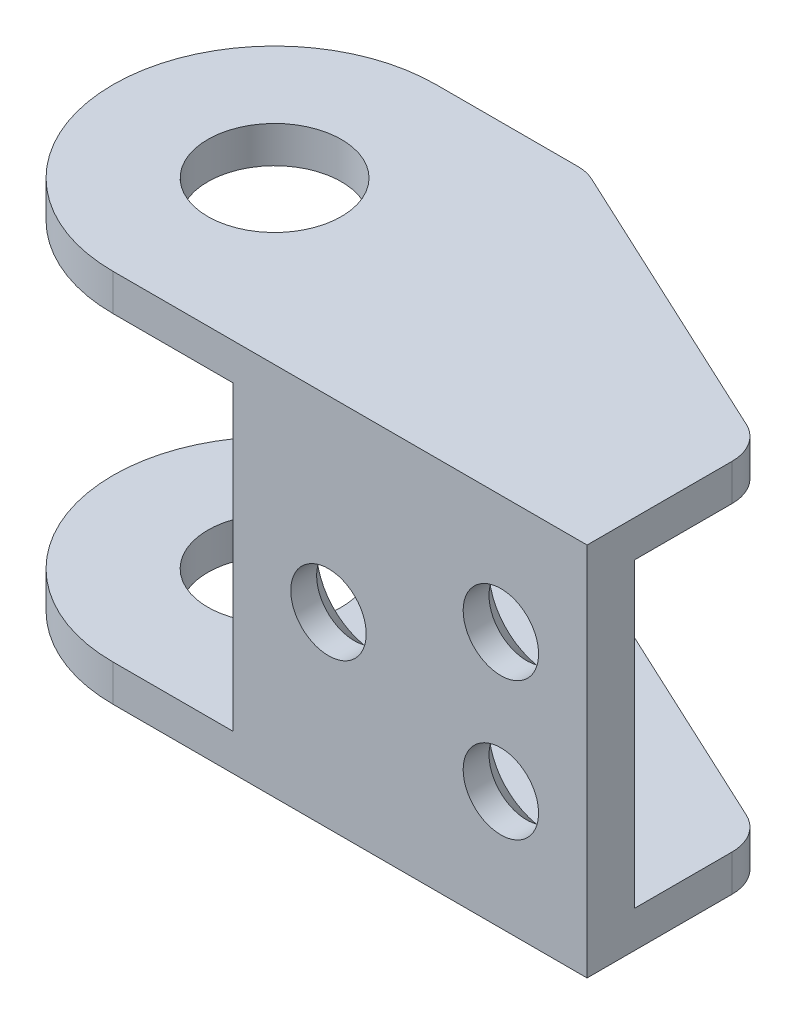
ISO-10303-21;
HEADER;
FILE_DESCRIPTION(('STEP AP214'),'2;1');
FILE_NAME('part.step','',(''),(''),'','','');
FILE_SCHEMA(('AUTOMOTIVE_DESIGN { 1 0 10303 214 1 1 1 1 }'));
ENDSEC;
DATA;
#1=APPLICATION_CONTEXT('core data for automotive mechanical design processes');
#2=APPLICATION_PROTOCOL_DEFINITION('international standard','automotive_design',2000,#1);
#3=PRODUCT_CONTEXT('',#1,'mechanical');
#4=PRODUCT('Part','Part','',(#3));
#5=PRODUCT_RELATED_PRODUCT_CATEGORY('part','',(#4));
#6=PRODUCT_DEFINITION_FORMATION('','',#4);
#7=PRODUCT_DEFINITION_CONTEXT('part definition',#1,'design');
#8=PRODUCT_DEFINITION('design','',#6,#7);
#9=PRODUCT_DEFINITION_SHAPE('','',#8);
#10=(LENGTH_UNIT() NAMED_UNIT(*) SI_UNIT(.MILLI.,.METRE.));
#11=(NAMED_UNIT(*) PLANE_ANGLE_UNIT() SI_UNIT($,.RADIAN.));
#12=(NAMED_UNIT(*) SI_UNIT($,.STERADIAN.) SOLID_ANGLE_UNIT());
#13=UNCERTAINTY_MEASURE_WITH_UNIT(LENGTH_MEASURE(1.E-05),#10,'distance_accuracy_value','');
#14=(GEOMETRIC_REPRESENTATION_CONTEXT(3) GLOBAL_UNCERTAINTY_ASSIGNED_CONTEXT((#13)) GLOBAL_UNIT_ASSIGNED_CONTEXT((#10,
#11,#12)) REPRESENTATION_CONTEXT('',''));
#15=CARTESIAN_POINT('',(0.,0.,0.));
#16=DIRECTION('',(0.,0.,1.));
#17=DIRECTION('',(1.,0.,0.));
#18=AXIS2_PLACEMENT_3D('',#15,#16,#17);
#19=CARTESIAN_POINT('',(-511.,5.,61.3));
#20=DIRECTION('',(0.,0.,1.));
#21=DIRECTION('',(1.,0.,0.));
#22=AXIS2_PLACEMENT_3D('',#19,#20,#21);
#23=PLANE('',#22);
#24=CARTESIAN_POINT('',(-507.,8.2,61.3));
#25=DIRECTION('',(0.,0.,-1.));
#26=DIRECTION('',(-1.,0.,0.));
#27=AXIS2_PLACEMENT_3D('',#24,#25,#26);
#28=CIRCLE('',#27,2.75000000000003);
#29=CARTESIAN_POINT('',(-509.75,8.2,61.3));
#30=VERTEX_POINT('',#29);
#31=EDGE_CURVE('E657',#30,#30,#28,.T.);
#32=ORIENTED_EDGE('',*,*,#31,.F.);
#33=EDGE_LOOP('',(#32));
#34=FACE_BOUND('',#33,.T.);
#35=CARTESIAN_POINT('',(-507.,1.8,61.3));
#36=DIRECTION('',(0.,0.,-1.));
#37=DIRECTION('',(-1.,0.,0.));
#38=AXIS2_PLACEMENT_3D('',#35,#36,#37);
#39=CIRCLE('',#38,2.75000000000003);
#40=CARTESIAN_POINT('',(-509.75,1.8,61.3));
#41=VERTEX_POINT('',#40);
#42=EDGE_CURVE('E648',#41,#41,#39,.T.);
#43=ORIENTED_EDGE('',*,*,#42,.F.);
#44=EDGE_LOOP('',(#43));
#45=FACE_BOUND('',#44,.T.);
#46=CARTESIAN_POINT('',(-515.,5.,61.3));
#47=DIRECTION('',(0.,0.,-1.));
#48=DIRECTION('',(-1.,0.,0.));
#49=AXIS2_PLACEMENT_3D('',#46,#47,#48);
#50=CIRCLE('',#49,2.75000000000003);
#51=CARTESIAN_POINT('',(-517.75,5.,61.3));
#52=VERTEX_POINT('',#51);
#53=EDGE_CURVE('E630',#52,#52,#50,.T.);
#54=ORIENTED_EDGE('',*,*,#53,.F.);
#55=EDGE_LOOP('',(#54));
#56=FACE_BOUND('',#55,.T.);
#57=DIRECTION('',(-1.,0.,0.));
#58=VECTOR('',#57,1.);
#59=CARTESIAN_POINT('',(-490.08760285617,12.,61.3));
#60=LINE('',#59,#58);
#61=CARTESIAN_POINT('',(-503.,12.,61.3));
#62=VERTEX_POINT('',#61);
#63=CARTESIAN_POINT('',(-519.44,12.,61.3));
#64=VERTEX_POINT('',#63);
#65=EDGE_CURVE('E235',#62,#64,#60,.T.);
#66=ORIENTED_EDGE('',*,*,#65,.F.);
#67=DIRECTION('',(0.,1.,0.));
#68=VECTOR('',#67,1.);
#69=CARTESIAN_POINT('',(-503.,5.,61.3));
#70=LINE('',#69,#68);
#71=CARTESIAN_POINT('',(-503.,-2.,61.3));
#72=VERTEX_POINT('',#71);
#73=EDGE_CURVE('E225',#72,#62,#70,.T.);
#74=ORIENTED_EDGE('',*,*,#73,.F.);
#75=DIRECTION('',(-1.,0.,0.));
#76=VECTOR('',#75,1.);
#77=CARTESIAN_POINT('',(-490.08760285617,-2.,61.3));
#78=LINE('',#77,#76);
#79=CARTESIAN_POINT('',(-519.44,-2.,61.3));
#80=VERTEX_POINT('',#79);
#81=EDGE_CURVE('E202',#72,#80,#78,.T.);
#82=ORIENTED_EDGE('',*,*,#81,.T.);
#83=DIRECTION('',(0.,1.,0.));
#84=VECTOR('',#83,1.);
#85=CARTESIAN_POINT('',(-519.44,10.,61.3));
#86=LINE('',#85,#84);
#87=EDGE_CURVE('E214',#80,#64,#86,.T.);
#88=ORIENTED_EDGE('',*,*,#87,.T.);
#89=EDGE_LOOP('',(#66,#74,#82,#88));
#90=FACE_BOUND('',#89,.T.);
#91=ADVANCED_FACE('F49',(#34,#45,#56,#90),#23,.F.);
#92=CARTESIAN_POINT('',(-525.,11.85,56.));
#93=DIRECTION('',(0.,1.,0.));
#94=DIRECTION('',(0.,0.,1.));
#95=AXIS2_PLACEMENT_3D('',#92,#93,#94);
#96=CYLINDRICAL_SURFACE('',#95,7.5);
#97=DIRECTION('',(0.,1.,0.));
#98=VECTOR('',#97,1.);
#99=CARTESIAN_POINT('',(-525.,11.85,63.5));
#100=LINE('',#99,#98);
#101=CARTESIAN_POINT('',(-525.,12.,63.5));
#102=VERTEX_POINT('',#101);
#103=CARTESIAN_POINT('',(-525.,13.7,63.5));
#104=VERTEX_POINT('',#103);
#105=EDGE_CURVE('E221',#102,#104,#100,.T.);
#106=ORIENTED_EDGE('',*,*,#105,.T.);
#107=CARTESIAN_POINT('',(-525.,13.7,56.));
#108=DIRECTION('',(0.,1.,0.));
#109=DIRECTION('',(0.,0.,1.));
#110=AXIS2_PLACEMENT_3D('',#107,#108,#109);
#111=CIRCLE('',#110,7.5);
#112=CARTESIAN_POINT('',(-525.,13.7,48.5));
#113=VERTEX_POINT('',#112);
#114=EDGE_CURVE('E288',#113,#104,#111,.T.);
#115=ORIENTED_EDGE('',*,*,#114,.F.);
#116=DIRECTION('',(0.,1.,0.));
#117=VECTOR('',#116,1.);
#118=CARTESIAN_POINT('',(-525.,11.85,48.5));
#119=LINE('',#118,#117);
#120=CARTESIAN_POINT('',(-525.,12.,48.5));
#121=VERTEX_POINT('',#120);
#122=EDGE_CURVE('E268',#113,#121,#119,.F.);
#123=ORIENTED_EDGE('',*,*,#122,.T.);
#124=CARTESIAN_POINT('',(-525.,12.,56.));
#125=DIRECTION('',(0.,1.,0.));
#126=DIRECTION('',(0.,0.,1.));
#127=AXIS2_PLACEMENT_3D('',#124,#125,#126);
#128=CIRCLE('',#127,7.5);
#129=EDGE_CURVE('E292',#121,#102,#128,.T.);
#130=ORIENTED_EDGE('',*,*,#129,.T.);
#131=EDGE_LOOP('',(#106,#115,#123,#130));
#132=FACE_BOUND('',#131,.T.);
#133=ADVANCED_FACE('F348',(#132),#96,.T.);
#134=CARTESIAN_POINT('',(-525.,11.85,56.));
#135=DIRECTION('',(0.,1.,0.));
#136=DIRECTION('',(0.,0.,1.));
#137=AXIS2_PLACEMENT_3D('',#134,#135,#136);
#138=CYLINDRICAL_SURFACE('',#137,3.1);
#139=CARTESIAN_POINT('',(-525.,13.7,56.));
#140=DIRECTION('',(0.,1.,0.));
#141=DIRECTION('',(0.,0.,1.));
#142=AXIS2_PLACEMENT_3D('',#139,#140,#141);
#143=CIRCLE('',#142,3.1);
#144=CARTESIAN_POINT('',(-525.,13.7,59.1));
#145=VERTEX_POINT('',#144);
#146=EDGE_CURVE('E283',#145,#145,#143,.F.);
#147=ORIENTED_EDGE('',*,*,#146,.F.);
#148=EDGE_LOOP('',(#147));
#149=FACE_BOUND('',#148,.T.);
#150=CARTESIAN_POINT('',(-525.,12.,56.));
#151=DIRECTION('',(0.,1.,0.));
#152=DIRECTION('',(0.,0.,1.));
#153=AXIS2_PLACEMENT_3D('',#150,#151,#152);
#154=CIRCLE('',#153,3.1);
#155=CARTESIAN_POINT('',(-525.,12.,59.1));
#156=VERTEX_POINT('',#155);
#157=EDGE_CURVE('E258',#156,#156,#154,.F.);
#158=ORIENTED_EDGE('',*,*,#157,.T.);
#159=EDGE_LOOP('',(#158));
#160=FACE_BOUND('',#159,.T.);
#161=ADVANCED_FACE('F485',(#149,#160),#138,.F.);
#162=CARTESIAN_POINT('',(-514.,11.85,48.5));
#163=DIRECTION('',(0.,0.,1.));
#164=DIRECTION('',(1.,0.,0.));
#165=AXIS2_PLACEMENT_3D('',#162,#163,#164);
#166=PLANE('',#165);
#167=DIRECTION('',(1.,0.,0.));
#168=VECTOR('',#167,1.);
#169=CARTESIAN_POINT('',(-525.,13.7,48.5));
#170=LINE('',#169,#168);
#171=CARTESIAN_POINT('',(-518.443389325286,13.7,48.5));
#172=VERTEX_POINT('',#171);
#173=EDGE_CURVE('E291',#172,#113,#170,.F.);
#174=ORIENTED_EDGE('',*,*,#173,.F.);
#175=DIRECTION('',(0.,-1.,0.));
#176=VECTOR('',#175,1.);
#177=CARTESIAN_POINT('',(-518.443389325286,11.85,48.5));
#178=LINE('',#177,#176);
#179=CARTESIAN_POINT('',(-518.443389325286,12.,48.5));
#180=VERTEX_POINT('',#179);
#181=EDGE_CURVE('E317',#172,#180,#178,.T.);
#182=ORIENTED_EDGE('',*,*,#181,.T.);
#183=DIRECTION('',(1.,0.,0.));
#184=VECTOR('',#183,1.);
#185=CARTESIAN_POINT('',(-525.,12.,48.5));
#186=LINE('',#185,#184);
#187=EDGE_CURVE('E294',#180,#121,#186,.F.);
#188=ORIENTED_EDGE('',*,*,#187,.T.);
#189=ORIENTED_EDGE('',*,*,#122,.F.);
#190=EDGE_LOOP('',(#174,#182,#188,#189));
#191=FACE_BOUND('',#190,.T.);
#192=ADVANCED_FACE('F482',(#191),#166,.F.);
#193=CARTESIAN_POINT('',(-525.,-1.85,56.));
#194=DIRECTION('',(0.,-1.,0.));
#195=DIRECTION('',(0.,0.,-1.));
#196=AXIS2_PLACEMENT_3D('',#193,#194,#195);
#197=CYLINDRICAL_SURFACE('',#196,3.1);
#198=CARTESIAN_POINT('',(-525.,-2.,56.));
#199=DIRECTION('',(0.,-1.,0.));
#200=DIRECTION('',(0.,0.,-1.));
#201=AXIS2_PLACEMENT_3D('',#198,#199,#200);
#202=CIRCLE('',#201,3.1);
#203=CARTESIAN_POINT('',(-525.,-2.,52.9));
#204=VERTEX_POINT('',#203);
#205=EDGE_CURVE('E243',#204,#204,#202,.F.);
#206=ORIENTED_EDGE('',*,*,#205,.T.);
#207=EDGE_LOOP('',(#206));
#208=FACE_BOUND('',#207,.T.);
#209=CARTESIAN_POINT('',(-525.,-3.7,56.));
#210=DIRECTION('',(0.,-1.,0.));
#211=DIRECTION('',(0.,0.,-1.));
#212=AXIS2_PLACEMENT_3D('',#209,#210,#211);
#213=CIRCLE('',#212,3.1);
#214=CARTESIAN_POINT('',(-525.,-3.7,52.9));
#215=VERTEX_POINT('',#214);
#216=EDGE_CURVE('E275',#215,#215,#213,.F.);
#217=ORIENTED_EDGE('',*,*,#216,.F.);
#218=EDGE_LOOP('',(#217));
#219=FACE_BOUND('',#218,.T.);
#220=ADVANCED_FACE('F484',(#208,#219),#197,.F.);
#221=CARTESIAN_POINT('',(-514.,-1.85,48.5));
#222=DIRECTION('',(0.,0.,1.));
#223=DIRECTION('',(1.,0.,0.));
#224=AXIS2_PLACEMENT_3D('',#221,#222,#223);
#225=PLANE('',#224);
#226=DIRECTION('',(1.,0.,0.));
#227=VECTOR('',#226,1.);
#228=CARTESIAN_POINT('',(-525.,-2.,48.5));
#229=LINE('',#228,#227);
#230=CARTESIAN_POINT('',(-525.,-2.,48.5));
#231=VERTEX_POINT('',#230);
#232=CARTESIAN_POINT('',(-518.443389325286,-2.,48.5));
#233=VERTEX_POINT('',#232);
#234=EDGE_CURVE('E239',#231,#233,#229,.T.);
#235=ORIENTED_EDGE('',*,*,#234,.T.);
#236=DIRECTION('',(0.,-1.,0.));
#237=VECTOR('',#236,1.);
#238=CARTESIAN_POINT('',(-518.443389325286,-1.85,48.5));
#239=LINE('',#238,#237);
#240=CARTESIAN_POINT('',(-518.443389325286,-3.7,48.5));
#241=VERTEX_POINT('',#240);
#242=EDGE_CURVE('E384',#233,#241,#239,.T.);
#243=ORIENTED_EDGE('',*,*,#242,.T.);
#244=DIRECTION('',(1.,0.,0.));
#245=VECTOR('',#244,1.);
#246=CARTESIAN_POINT('',(-525.,-3.7,48.5));
#247=LINE('',#246,#245);
#248=CARTESIAN_POINT('',(-525.,-3.7,48.5));
#249=VERTEX_POINT('',#248);
#250=EDGE_CURVE('E254',#249,#241,#247,.T.);
#251=ORIENTED_EDGE('',*,*,#250,.F.);
#252=DIRECTION('',(0.,1.,0.));
#253=VECTOR('',#252,1.);
#254=CARTESIAN_POINT('',(-525.,-1.85,48.5));
#255=LINE('',#254,#253);
#256=EDGE_CURVE('E338',#231,#249,#255,.F.);
#257=ORIENTED_EDGE('',*,*,#256,.F.);
#258=EDGE_LOOP('',(#235,#243,#251,#257));
#259=FACE_BOUND('',#258,.T.);
#260=ADVANCED_FACE('F491',(#259),#225,.F.);
#261=CARTESIAN_POINT('',(-525.,-1.85,56.));
#262=DIRECTION('',(0.,-1.,0.));
#263=DIRECTION('',(0.,0.,-1.));
#264=AXIS2_PLACEMENT_3D('',#261,#262,#263);
#265=CYLINDRICAL_SURFACE('',#264,7.5);
#266=DIRECTION('',(0.,-1.,0.));
#267=VECTOR('',#266,1.);
#268=CARTESIAN_POINT('',(-525.,-1.85,63.5));
#269=LINE('',#268,#267);
#270=CARTESIAN_POINT('',(-525.,-3.7,63.5));
#271=VERTEX_POINT('',#270);
#272=CARTESIAN_POINT('',(-525.,-2.,63.5));
#273=VERTEX_POINT('',#272);
#274=EDGE_CURVE('E263',#271,#273,#269,.F.);
#275=ORIENTED_EDGE('',*,*,#274,.T.);
#276=CARTESIAN_POINT('',(-525.,-2.,56.));
#277=DIRECTION('',(0.,-1.,0.));
#278=DIRECTION('',(0.,0.,-1.));
#279=AXIS2_PLACEMENT_3D('',#276,#277,#278);
#280=CIRCLE('',#279,7.5);
#281=EDGE_CURVE('E211',#273,#231,#280,.T.);
#282=ORIENTED_EDGE('',*,*,#281,.T.);
#283=ORIENTED_EDGE('',*,*,#256,.T.);
#284=CARTESIAN_POINT('',(-525.,-3.7,56.));
#285=DIRECTION('',(0.,-1.,0.));
#286=DIRECTION('',(0.,0.,-1.));
#287=AXIS2_PLACEMENT_3D('',#284,#285,#286);
#288=CIRCLE('',#287,7.5);
#289=EDGE_CURVE('E279',#271,#249,#288,.T.);
#290=ORIENTED_EDGE('',*,*,#289,.F.);
#291=EDGE_LOOP('',(#275,#282,#283,#290));
#292=FACE_BOUND('',#291,.T.);
#293=ADVANCED_FACE('F528',(#292),#265,.T.);
#294=CARTESIAN_POINT('',(-525.,12.,56.));
#295=DIRECTION('',(0.,1.,0.));
#296=DIRECTION('',(0.,0.,1.));
#297=AXIS2_PLACEMENT_3D('',#294,#295,#296);
#298=PLANE('',#297);
#299=ORIENTED_EDGE('',*,*,#187,.F.);
#300=CARTESIAN_POINT('',(-518.443389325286,12.,50.5));
#301=DIRECTION('',(0.,1.,0.));
#302=DIRECTION('',(0.,0.,1.));
#303=AXIS2_PLACEMENT_3D('',#300,#301,#302);
#304=CIRCLE('',#303,2.);
#305=CARTESIAN_POINT('',(-517.598152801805,12.,48.6873844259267));
#306=VERTEX_POINT('',#305);
#307=EDGE_CURVE('E413',#180,#306,#304,.F.);
#308=ORIENTED_EDGE('',*,*,#307,.T.);
#309=DIRECTION('',(0.906307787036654,0.,0.422618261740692));
#310=VECTOR('',#309,1.);
#311=CARTESIAN_POINT('',(-520.877089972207,12.,47.158390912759));
#312=LINE('',#311,#310);
#313=CARTESIAN_POINT('',(-504.154763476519,12.,54.9561398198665));
#314=VERTEX_POINT('',#313);
#315=EDGE_CURVE('E459',#306,#314,#312,.T.);
#316=ORIENTED_EDGE('',*,*,#315,.T.);
#317=CARTESIAN_POINT('',(-505.,12.,56.7687553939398));
#318=DIRECTION('',(0.,1.,0.));
#319=DIRECTION('',(0.,0.,1.));
#320=AXIS2_PLACEMENT_3D('',#317,#318,#319);
#321=CIRCLE('',#320,2.);
#322=CARTESIAN_POINT('',(-503.,12.,56.7687553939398));
#323=VERTEX_POINT('',#322);
#324=EDGE_CURVE('E408',#314,#323,#321,.F.);
#325=ORIENTED_EDGE('',*,*,#324,.T.);
#326=DIRECTION('',(0.,0.,1.));
#327=VECTOR('',#326,1.);
#328=CARTESIAN_POINT('',(-503.,12.,61.3));
#329=LINE('',#328,#327);
#330=EDGE_CURVE('E228',#323,#62,#329,.T.);
#331=ORIENTED_EDGE('',*,*,#330,.T.);
#332=ORIENTED_EDGE('',*,*,#65,.T.);
#333=DIRECTION('',(0.,0.,1.));
#334=VECTOR('',#333,1.);
#335=CARTESIAN_POINT('',(-519.44,12.,56.));
#336=LINE('',#335,#334);
#337=CARTESIAN_POINT('',(-519.44,12.,63.5));
#338=VERTEX_POINT('',#337);
#339=EDGE_CURVE('E216',#338,#64,#336,.F.);
#340=ORIENTED_EDGE('',*,*,#339,.F.);
#341=DIRECTION('',(-1.,0.,0.));
#342=VECTOR('',#341,1.);
#343=CARTESIAN_POINT('',(-511.,12.,63.5));
#344=LINE('',#343,#342);
#345=EDGE_CURVE('E325',#338,#102,#344,.T.);
#346=ORIENTED_EDGE('',*,*,#345,.T.);
#347=ORIENTED_EDGE('',*,*,#129,.F.);
#348=EDGE_LOOP('',(#299,#308,#316,#325,#331,#332,#340,#346,#347));
#349=FACE_BOUND('',#348,.T.);
#350=ORIENTED_EDGE('',*,*,#157,.F.);
#351=EDGE_LOOP('',(#350));
#352=FACE_BOUND('',#351,.T.);
#353=ADVANCED_FACE('F351',(#349,#352),#298,.F.);
#354=CARTESIAN_POINT('',(-525.,13.7,56.));
#355=DIRECTION('',(0.,1.,0.));
#356=DIRECTION('',(0.,0.,1.));
#357=AXIS2_PLACEMENT_3D('',#354,#355,#356);
#358=PLANE('',#357);
#359=DIRECTION('',(0.906307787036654,0.,0.422618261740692));
#360=VECTOR('',#359,1.);
#361=CARTESIAN_POINT('',(-520.877089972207,13.7,47.158390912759));
#362=LINE('',#361,#360);
#363=CARTESIAN_POINT('',(-517.598152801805,13.7,48.6873844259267));
#364=VERTEX_POINT('',#363);
#365=CARTESIAN_POINT('',(-504.154763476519,13.7,54.9561398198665));
#366=VERTEX_POINT('',#365);
#367=EDGE_CURVE('E452',#364,#366,#362,.T.);
#368=ORIENTED_EDGE('',*,*,#367,.F.);
#369=CARTESIAN_POINT('',(-518.443389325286,13.7,50.5));
#370=DIRECTION('',(0.,1.,0.));
#371=DIRECTION('',(0.,0.,1.));
#372=AXIS2_PLACEMENT_3D('',#369,#370,#371);
#373=CIRCLE('',#372,2.);
#374=EDGE_CURVE('E429',#364,#172,#373,.T.);
#375=ORIENTED_EDGE('',*,*,#374,.T.);
#376=ORIENTED_EDGE('',*,*,#173,.T.);
#377=ORIENTED_EDGE('',*,*,#114,.T.);
#378=DIRECTION('',(-1.,0.,0.));
#379=VECTOR('',#378,1.);
#380=CARTESIAN_POINT('',(-511.,13.7,63.5));
#381=LINE('',#380,#379);
#382=CARTESIAN_POINT('',(-503.,13.7,63.5));
#383=VERTEX_POINT('',#382);
#384=EDGE_CURVE('E329',#104,#383,#381,.F.);
#385=ORIENTED_EDGE('',*,*,#384,.T.);
#386=DIRECTION('',(0.,0.,1.));
#387=VECTOR('',#386,1.);
#388=CARTESIAN_POINT('',(-503.,13.7,62.4));
#389=LINE('',#388,#387);
#390=CARTESIAN_POINT('',(-503.,13.7,56.7687553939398));
#391=VERTEX_POINT('',#390);
#392=EDGE_CURVE('E287',#383,#391,#389,.F.);
#393=ORIENTED_EDGE('',*,*,#392,.T.);
#394=CARTESIAN_POINT('',(-505.,13.7,56.7687553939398));
#395=DIRECTION('',(0.,1.,0.));
#396=DIRECTION('',(0.,0.,1.));
#397=AXIS2_PLACEMENT_3D('',#394,#395,#396);
#398=CIRCLE('',#397,2.);
#399=EDGE_CURVE('E75',#391,#366,#398,.T.);
#400=ORIENTED_EDGE('',*,*,#399,.T.);
#401=EDGE_LOOP('',(#368,#375,#376,#377,#385,#393,#400));
#402=FACE_BOUND('',#401,.T.);
#403=ORIENTED_EDGE('',*,*,#146,.T.);
#404=EDGE_LOOP('',(#403));
#405=FACE_BOUND('',#404,.T.);
#406=ADVANCED_FACE('F480',(#402,#405),#358,.T.);
#407=CARTESIAN_POINT('',(-503.,5.,62.4));
#408=DIRECTION('',(-1.,0.,0.));
#409=DIRECTION('',(0.,0.,1.));
#410=AXIS2_PLACEMENT_3D('',#407,#408,#409);
#411=PLANE('',#410);
#412=ORIENTED_EDGE('',*,*,#330,.F.);
#413=DIRECTION('',(0.,-1.,0.));
#414=VECTOR('',#413,1.);
#415=CARTESIAN_POINT('',(-503.,5.,56.7687553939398));
#416=LINE('',#415,#414);
#417=EDGE_CURVE('E11',#323,#391,#416,.F.);
#418=ORIENTED_EDGE('',*,*,#417,.T.);
#419=ORIENTED_EDGE('',*,*,#392,.F.);
#420=DIRECTION('',(0.,1.,0.));
#421=VECTOR('',#420,1.);
#422=CARTESIAN_POINT('',(-503.,5.,63.5));
#423=LINE('',#422,#421);
#424=CARTESIAN_POINT('',(-503.,-3.7,63.5));
#425=VERTEX_POINT('',#424);
#426=EDGE_CURVE('E361',#383,#425,#423,.F.);
#427=ORIENTED_EDGE('',*,*,#426,.T.);
#428=DIRECTION('',(0.,0.,-1.));
#429=VECTOR('',#428,1.);
#430=CARTESIAN_POINT('',(-503.,-3.7,56.));
#431=LINE('',#430,#429);
#432=CARTESIAN_POINT('',(-503.,-3.7,56.7687553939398));
#433=VERTEX_POINT('',#432);
#434=EDGE_CURVE('E282',#433,#425,#431,.F.);
#435=ORIENTED_EDGE('',*,*,#434,.F.);
#436=DIRECTION('',(0.,-1.,0.));
#437=VECTOR('',#436,1.);
#438=CARTESIAN_POINT('',(-503.,5.,56.7687553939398));
#439=LINE('',#438,#437);
#440=CARTESIAN_POINT('',(-503.,-2.,56.7687553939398));
#441=VERTEX_POINT('',#440);
#442=EDGE_CURVE('E58',#433,#441,#439,.F.);
#443=ORIENTED_EDGE('',*,*,#442,.T.);
#444=DIRECTION('',(0.,0.,-1.));
#445=VECTOR('',#444,1.);
#446=CARTESIAN_POINT('',(-503.,-2.,48.5));
#447=LINE('',#446,#445);
#448=EDGE_CURVE('E222',#72,#441,#447,.T.);
#449=ORIENTED_EDGE('',*,*,#448,.F.);
#450=ORIENTED_EDGE('',*,*,#73,.T.);
#451=EDGE_LOOP('',(#412,#418,#419,#427,#435,#443,#449,#450));
#452=FACE_BOUND('',#451,.T.);
#453=ADVANCED_FACE('F436',(#452),#411,.F.);
#454=CARTESIAN_POINT('',(-525.,-3.7,56.));
#455=DIRECTION('',(0.,-1.,0.));
#456=DIRECTION('',(0.,0.,-1.));
#457=AXIS2_PLACEMENT_3D('',#454,#455,#456);
#458=PLANE('',#457);
#459=ORIENTED_EDGE('',*,*,#250,.T.);
#460=CARTESIAN_POINT('',(-518.443389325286,-3.7,50.5));
#461=DIRECTION('',(0.,-1.,0.));
#462=DIRECTION('',(0.,0.,-1.));
#463=AXIS2_PLACEMENT_3D('',#460,#461,#462);
#464=CIRCLE('',#463,2.);
#465=CARTESIAN_POINT('',(-517.598152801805,-3.7,48.6873844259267));
#466=VERTEX_POINT('',#465);
#467=EDGE_CURVE('E389',#241,#466,#464,.T.);
#468=ORIENTED_EDGE('',*,*,#467,.T.);
#469=DIRECTION('',(-0.906307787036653,0.,-0.422618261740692));
#470=VECTOR('',#469,1.);
#471=CARTESIAN_POINT('',(-503.,-3.7,55.4946148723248));
#472=LINE('',#471,#470);
#473=CARTESIAN_POINT('',(-504.154763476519,-3.7,54.9561398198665));
#474=VERTEX_POINT('',#473);
#475=EDGE_CURVE('E445',#474,#466,#472,.T.);
#476=ORIENTED_EDGE('',*,*,#475,.F.);
#477=CARTESIAN_POINT('',(-505.,-3.7,56.7687553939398));
#478=DIRECTION('',(0.,-1.,0.));
#479=DIRECTION('',(0.,0.,-1.));
#480=AXIS2_PLACEMENT_3D('',#477,#478,#479);
#481=CIRCLE('',#480,2.);
#482=EDGE_CURVE('E386',#474,#433,#481,.T.);
#483=ORIENTED_EDGE('',*,*,#482,.T.);
#484=ORIENTED_EDGE('',*,*,#434,.T.);
#485=DIRECTION('',(-1.,0.,0.));
#486=VECTOR('',#485,1.);
#487=CARTESIAN_POINT('',(-511.,-3.7,63.5));
#488=LINE('',#487,#486);
#489=EDGE_CURVE('E249',#425,#271,#488,.T.);
#490=ORIENTED_EDGE('',*,*,#489,.T.);
#491=ORIENTED_EDGE('',*,*,#289,.T.);
#492=EDGE_LOOP('',(#459,#468,#476,#483,#484,#490,#491));
#493=FACE_BOUND('',#492,.T.);
#494=ORIENTED_EDGE('',*,*,#216,.T.);
#495=EDGE_LOOP('',(#494));
#496=FACE_BOUND('',#495,.T.);
#497=ADVANCED_FACE('F449',(#493,#496),#458,.T.);
#498=CARTESIAN_POINT('',(-525.,-2.,56.));
#499=DIRECTION('',(0.,-1.,0.));
#500=DIRECTION('',(0.,0.,-1.));
#501=AXIS2_PLACEMENT_3D('',#498,#499,#500);
#502=PLANE('',#501);
#503=DIRECTION('',(-0.906307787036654,0.,-0.422618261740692));
#504=VECTOR('',#503,1.);
#505=CARTESIAN_POINT('',(-520.877089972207,-2.,47.158390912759));
#506=LINE('',#505,#504);
#507=CARTESIAN_POINT('',(-504.154763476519,-2.,54.9561398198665));
#508=VERTEX_POINT('',#507);
#509=CARTESIAN_POINT('',(-517.598152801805,-2.,48.6873844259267));
#510=VERTEX_POINT('',#509);
#511=EDGE_CURVE('E248',#508,#510,#506,.T.);
#512=ORIENTED_EDGE('',*,*,#511,.T.);
#513=CARTESIAN_POINT('',(-518.443389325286,-2.,50.5));
#514=DIRECTION('',(0.,-1.,0.));
#515=DIRECTION('',(0.,0.,-1.));
#516=AXIS2_PLACEMENT_3D('',#513,#514,#515);
#517=CIRCLE('',#516,2.);
#518=EDGE_CURVE('E401',#510,#233,#517,.F.);
#519=ORIENTED_EDGE('',*,*,#518,.T.);
#520=ORIENTED_EDGE('',*,*,#234,.F.);
#521=ORIENTED_EDGE('',*,*,#281,.F.);
#522=DIRECTION('',(-1.,0.,0.));
#523=VECTOR('',#522,1.);
#524=CARTESIAN_POINT('',(-511.,-2.,63.5));
#525=LINE('',#524,#523);
#526=CARTESIAN_POINT('',(-519.44,-2.,63.5));
#527=VERTEX_POINT('',#526);
#528=EDGE_CURVE('E205',#273,#527,#525,.F.);
#529=ORIENTED_EDGE('',*,*,#528,.T.);
#530=DIRECTION('',(0.,0.,1.));
#531=VECTOR('',#530,1.);
#532=CARTESIAN_POINT('',(-519.44,-2.,56.));
#533=LINE('',#532,#531);
#534=EDGE_CURVE('E195',#80,#527,#533,.T.);
#535=ORIENTED_EDGE('',*,*,#534,.F.);
#536=ORIENTED_EDGE('',*,*,#81,.F.);
#537=ORIENTED_EDGE('',*,*,#448,.T.);
#538=CARTESIAN_POINT('',(-505.,-2.,56.7687553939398));
#539=DIRECTION('',(0.,-1.,0.));
#540=DIRECTION('',(0.,0.,-1.));
#541=AXIS2_PLACEMENT_3D('',#538,#539,#540);
#542=CIRCLE('',#541,2.);
#543=EDGE_CURVE('E399',#441,#508,#542,.F.);
#544=ORIENTED_EDGE('',*,*,#543,.T.);
#545=EDGE_LOOP('',(#512,#519,#520,#521,#529,#535,#536,#537,#544));
#546=FACE_BOUND('',#545,.T.);
#547=ORIENTED_EDGE('',*,*,#205,.F.);
#548=EDGE_LOOP('',(#547));
#549=FACE_BOUND('',#548,.T.);
#550=ADVANCED_FACE('F198',(#546,#549),#502,.F.);
#551=CARTESIAN_POINT('',(-519.44,-1.,56.));
#552=DIRECTION('',(-1.,0.,0.));
#553=DIRECTION('',(0.,0.,1.));
#554=AXIS2_PLACEMENT_3D('',#551,#552,#553);
#555=PLANE('',#554);
#556=ORIENTED_EDGE('',*,*,#87,.F.);
#557=ORIENTED_EDGE('',*,*,#534,.T.);
#558=DIRECTION('',(0.,1.,0.));
#559=VECTOR('',#558,1.);
#560=CARTESIAN_POINT('',(-519.44,5.,63.5));
#561=LINE('',#560,#559);
#562=EDGE_CURVE('E210',#527,#338,#561,.T.);
#563=ORIENTED_EDGE('',*,*,#562,.T.);
#564=ORIENTED_EDGE('',*,*,#339,.T.);
#565=EDGE_LOOP('',(#556,#557,#563,#564));
#566=FACE_BOUND('',#565,.T.);
#567=ADVANCED_FACE('F215',(#566),#555,.T.);
#568=CARTESIAN_POINT('',(-511.,5.,63.5));
#569=DIRECTION('',(0.,0.,-1.));
#570=DIRECTION('',(-1.,0.,0.));
#571=AXIS2_PLACEMENT_3D('',#568,#569,#570);
#572=PLANE('',#571);
#573=CARTESIAN_POINT('',(-507.,8.2,63.5));
#574=DIRECTION('',(0.,0.,-1.));
#575=DIRECTION('',(-1.,0.,0.));
#576=AXIS2_PLACEMENT_3D('',#573,#574,#575);
#577=CIRCLE('',#576,1.75000000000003);
#578=CARTESIAN_POINT('',(-508.75,8.2,63.5));
#579=VERTEX_POINT('',#578);
#580=EDGE_CURVE('E645',#579,#579,#577,.T.);
#581=ORIENTED_EDGE('',*,*,#580,.T.);
#582=EDGE_LOOP('',(#581));
#583=FACE_BOUND('',#582,.T.);
#584=CARTESIAN_POINT('',(-507.,1.8,63.5));
#585=DIRECTION('',(0.,0.,-1.));
#586=DIRECTION('',(-1.,0.,0.));
#587=AXIS2_PLACEMENT_3D('',#584,#585,#586);
#588=CIRCLE('',#587,1.75000000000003);
#589=CARTESIAN_POINT('',(-508.75,1.8,63.5));
#590=VERTEX_POINT('',#589);
#591=EDGE_CURVE('E634',#590,#590,#588,.T.);
#592=ORIENTED_EDGE('',*,*,#591,.T.);
#593=EDGE_LOOP('',(#592));
#594=FACE_BOUND('',#593,.T.);
#595=CARTESIAN_POINT('',(-515.,5.,63.5));
#596=DIRECTION('',(0.,0.,-1.));
#597=DIRECTION('',(-1.,0.,0.));
#598=AXIS2_PLACEMENT_3D('',#595,#596,#597);
#599=CIRCLE('',#598,1.75000000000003);
#600=CARTESIAN_POINT('',(-516.75,5.,63.5));
#601=VERTEX_POINT('',#600);
#602=EDGE_CURVE('E453',#601,#601,#599,.T.);
#603=ORIENTED_EDGE('',*,*,#602,.T.);
#604=EDGE_LOOP('',(#603));
#605=FACE_BOUND('',#604,.T.);
#606=ORIENTED_EDGE('',*,*,#562,.F.);
#607=ORIENTED_EDGE('',*,*,#528,.F.);
#608=ORIENTED_EDGE('',*,*,#274,.F.);
#609=ORIENTED_EDGE('',*,*,#489,.F.);
#610=ORIENTED_EDGE('',*,*,#426,.F.);
#611=ORIENTED_EDGE('',*,*,#384,.F.);
#612=ORIENTED_EDGE('',*,*,#105,.F.);
#613=ORIENTED_EDGE('',*,*,#345,.F.);
#614=EDGE_LOOP('',(#606,#607,#608,#609,#610,#611,#612,#613));
#615=FACE_BOUND('',#614,.T.);
#616=ADVANCED_FACE('F355',(#583,#594,#605,#615),#572,.F.);
#617=CARTESIAN_POINT('',(-503.,13.7001030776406,55.4946148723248));
#618=DIRECTION('',(-0.422618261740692,0.,0.906307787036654));
#619=DIRECTION('',(0.906307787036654,0.,0.422618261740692));
#620=AXIS2_PLACEMENT_3D('',#617,#618,#619);
#621=PLANE('',#620);
#622=ORIENTED_EDGE('',*,*,#475,.T.);
#623=DIRECTION('',(0.,-1.,0.));
#624=VECTOR('',#623,1.);
#625=CARTESIAN_POINT('',(-517.598152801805,13.7001030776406,48.6873844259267));
#626=LINE('',#625,#624);
#627=EDGE_CURVE('E396',#466,#510,#626,.F.);
#628=ORIENTED_EDGE('',*,*,#627,.T.);
#629=ORIENTED_EDGE('',*,*,#511,.F.);
#630=DIRECTION('',(0.,-1.,0.));
#631=VECTOR('',#630,1.);
#632=CARTESIAN_POINT('',(-504.154763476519,13.7001030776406,54.9561398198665));
#633=LINE('',#632,#631);
#634=EDGE_CURVE('E392',#508,#474,#633,.T.);
#635=ORIENTED_EDGE('',*,*,#634,.T.);
#636=EDGE_LOOP('',(#622,#628,#629,#635));
#637=FACE_BOUND('',#636,.T.);
#638=ADVANCED_FACE('F444',(#637),#621,.F.);
#639=ORIENTED_EDGE('',*,*,#315,.F.);
#640=DIRECTION('',(0.,-1.,0.));
#641=VECTOR('',#640,1.);
#642=CARTESIAN_POINT('',(-517.598152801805,13.7001030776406,48.6873844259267));
#643=LINE('',#642,#641);
#644=EDGE_CURVE('E424',#306,#364,#643,.F.);
#645=ORIENTED_EDGE('',*,*,#644,.T.);
#646=ORIENTED_EDGE('',*,*,#367,.T.);
#647=DIRECTION('',(0.,-1.,0.));
#648=VECTOR('',#647,1.);
#649=CARTESIAN_POINT('',(-504.154763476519,13.7001030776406,54.9561398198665));
#650=LINE('',#649,#648);
#651=EDGE_CURVE('E418',#366,#314,#650,.T.);
#652=ORIENTED_EDGE('',*,*,#651,.T.);
#653=EDGE_LOOP('',(#639,#645,#646,#652));
#654=FACE_BOUND('',#653,.T.);
#655=ADVANCED_FACE('F475',(#654),#621,.F.);
#656=CARTESIAN_POINT('',(-515.,5.,61.3));
#657=DIRECTION('',(0.,0.,-1.));
#658=DIRECTION('',(-1.,0.,0.));
#659=AXIS2_PLACEMENT_3D('',#656,#657,#658);
#660=CYLINDRICAL_SURFACE('',#659,1.75000000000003);
#661=CARTESIAN_POINT('',(-515.,5.,62.3));
#662=DIRECTION('',(0.,0.,-1.));
#663=DIRECTION('',(-1.,0.,0.));
#664=AXIS2_PLACEMENT_3D('',#661,#662,#663);
#665=CIRCLE('',#664,1.75000000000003);
#666=CARTESIAN_POINT('',(-516.75,5.,62.3));
#667=VERTEX_POINT('',#666);
#668=EDGE_CURVE('E462',#667,#667,#665,.T.);
#669=ORIENTED_EDGE('',*,*,#668,.T.);
#670=EDGE_LOOP('',(#669));
#671=FACE_BOUND('',#670,.T.);
#672=ORIENTED_EDGE('',*,*,#602,.F.);
#673=EDGE_LOOP('',(#672));
#674=FACE_BOUND('',#673,.T.);
#675=ADVANCED_FACE('F690',(#671,#674),#660,.F.);
#676=CARTESIAN_POINT('',(-515.,5.,61.3));
#677=DIRECTION('',(0.,0.,-1.));
#678=DIRECTION('',(-1.,0.,0.));
#679=AXIS2_PLACEMENT_3D('',#676,#677,#678);
#680=CONICAL_SURFACE('',#679,2.75000000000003,0.785398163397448);
#681=ORIENTED_EDGE('',*,*,#668,.F.);
#682=EDGE_LOOP('',(#681));
#683=FACE_BOUND('',#682,.T.);
#684=ORIENTED_EDGE('',*,*,#53,.T.);
#685=EDGE_LOOP('',(#684));
#686=FACE_BOUND('',#685,.T.);
#687=ADVANCED_FACE('F688',(#683,#686),#680,.F.);
#688=CARTESIAN_POINT('',(-507.,1.8,61.3));
#689=DIRECTION('',(0.,0.,-1.));
#690=DIRECTION('',(-1.,0.,0.));
#691=AXIS2_PLACEMENT_3D('',#688,#689,#690);
#692=CYLINDRICAL_SURFACE('',#691,1.75000000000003);
#693=CARTESIAN_POINT('',(-507.,1.8,62.3));
#694=DIRECTION('',(0.,0.,-1.));
#695=DIRECTION('',(-1.,0.,0.));
#696=AXIS2_PLACEMENT_3D('',#693,#694,#695);
#697=CIRCLE('',#696,1.75000000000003);
#698=CARTESIAN_POINT('',(-508.75,1.8,62.3));
#699=VERTEX_POINT('',#698);
#700=EDGE_CURVE('E563',#699,#699,#697,.T.);
#701=ORIENTED_EDGE('',*,*,#700,.T.);
#702=EDGE_LOOP('',(#701));
#703=FACE_BOUND('',#702,.T.);
#704=ORIENTED_EDGE('',*,*,#591,.F.);
#705=EDGE_LOOP('',(#704));
#706=FACE_BOUND('',#705,.T.);
#707=ADVANCED_FACE('F676',(#703,#706),#692,.F.);
#708=CARTESIAN_POINT('',(-507.,1.8,61.3));
#709=DIRECTION('',(0.,0.,-1.));
#710=DIRECTION('',(-1.,0.,0.));
#711=AXIS2_PLACEMENT_3D('',#708,#709,#710);
#712=CONICAL_SURFACE('',#711,2.75000000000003,0.785398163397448);
#713=ORIENTED_EDGE('',*,*,#700,.F.);
#714=EDGE_LOOP('',(#713));
#715=FACE_BOUND('',#714,.T.);
#716=ORIENTED_EDGE('',*,*,#42,.T.);
#717=EDGE_LOOP('',(#716));
#718=FACE_BOUND('',#717,.T.);
#719=ADVANCED_FACE('F679',(#715,#718),#712,.F.);
#720=CARTESIAN_POINT('',(-507.,8.2,61.3));
#721=DIRECTION('',(0.,0.,-1.));
#722=DIRECTION('',(-1.,0.,0.));
#723=AXIS2_PLACEMENT_3D('',#720,#721,#722);
#724=CYLINDRICAL_SURFACE('',#723,1.75000000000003);
#725=CARTESIAN_POINT('',(-507.,8.2,62.3));
#726=DIRECTION('',(0.,0.,-1.));
#727=DIRECTION('',(-1.,0.,0.));
#728=AXIS2_PLACEMENT_3D('',#725,#726,#727);
#729=CIRCLE('',#728,1.75000000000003);
#730=CARTESIAN_POINT('',(-508.75,8.2,62.3));
#731=VERTEX_POINT('',#730);
#732=EDGE_CURVE('E649',#731,#731,#729,.T.);
#733=ORIENTED_EDGE('',*,*,#732,.T.);
#734=EDGE_LOOP('',(#733));
#735=FACE_BOUND('',#734,.T.);
#736=ORIENTED_EDGE('',*,*,#580,.F.);
#737=EDGE_LOOP('',(#736));
#738=FACE_BOUND('',#737,.T.);
#739=ADVANCED_FACE('F682',(#735,#738),#724,.F.);
#740=CARTESIAN_POINT('',(-507.,8.2,61.3));
#741=DIRECTION('',(0.,0.,-1.));
#742=DIRECTION('',(-1.,0.,0.));
#743=AXIS2_PLACEMENT_3D('',#740,#741,#742);
#744=CONICAL_SURFACE('',#743,2.75000000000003,0.785398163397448);
#745=ORIENTED_EDGE('',*,*,#732,.F.);
#746=EDGE_LOOP('',(#745));
#747=FACE_BOUND('',#746,.T.);
#748=ORIENTED_EDGE('',*,*,#31,.T.);
#749=EDGE_LOOP('',(#748));
#750=FACE_BOUND('',#749,.T.);
#751=ADVANCED_FACE('F703',(#747,#750),#744,.F.);
#752=CARTESIAN_POINT('',(-518.443389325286,-1.85,50.5));
#753=DIRECTION('',(0.,-1.,0.));
#754=DIRECTION('',(0.,0.,-1.));
#755=AXIS2_PLACEMENT_3D('',#752,#753,#754);
#756=CYLINDRICAL_SURFACE('',#755,2.);
#757=ORIENTED_EDGE('',*,*,#518,.F.);
#758=ORIENTED_EDGE('',*,*,#627,.F.);
#759=ORIENTED_EDGE('',*,*,#467,.F.);
#760=ORIENTED_EDGE('',*,*,#242,.F.);
#761=EDGE_LOOP('',(#757,#758,#759,#760));
#762=FACE_BOUND('',#761,.T.);
#763=ADVANCED_FACE('F545',(#762),#756,.T.);
#764=CARTESIAN_POINT('',(-518.443389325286,11.85,50.5));
#765=DIRECTION('',(0.,-1.,0.));
#766=DIRECTION('',(0.,0.,-1.));
#767=AXIS2_PLACEMENT_3D('',#764,#765,#766);
#768=CYLINDRICAL_SURFACE('',#767,2.);
#769=ORIENTED_EDGE('',*,*,#374,.F.);
#770=ORIENTED_EDGE('',*,*,#644,.F.);
#771=ORIENTED_EDGE('',*,*,#307,.F.);
#772=ORIENTED_EDGE('',*,*,#181,.F.);
#773=EDGE_LOOP('',(#769,#770,#771,#772));
#774=FACE_BOUND('',#773,.T.);
#775=ADVANCED_FACE('F479',(#774),#768,.T.);
#776=CARTESIAN_POINT('',(-505.,13.7001030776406,56.7687553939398));
#777=DIRECTION('',(0.,-1.,0.));
#778=DIRECTION('',(0.,0.,-1.));
#779=AXIS2_PLACEMENT_3D('',#776,#777,#778);
#780=CYLINDRICAL_SURFACE('',#779,2.);
#781=ORIENTED_EDGE('',*,*,#399,.F.);
#782=ORIENTED_EDGE('',*,*,#417,.F.);
#783=ORIENTED_EDGE('',*,*,#324,.F.);
#784=ORIENTED_EDGE('',*,*,#651,.F.);
#785=EDGE_LOOP('',(#781,#782,#783,#784));
#786=FACE_BOUND('',#785,.T.);
#787=ADVANCED_FACE('F471',(#786),#780,.T.);
#788=CARTESIAN_POINT('',(-505.,13.7001030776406,56.7687553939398));
#789=DIRECTION('',(0.,-1.,0.));
#790=DIRECTION('',(0.,0.,-1.));
#791=AXIS2_PLACEMENT_3D('',#788,#789,#790);
#792=CYLINDRICAL_SURFACE('',#791,2.);
#793=ORIENTED_EDGE('',*,*,#543,.F.);
#794=ORIENTED_EDGE('',*,*,#442,.F.);
#795=ORIENTED_EDGE('',*,*,#482,.F.);
#796=ORIENTED_EDGE('',*,*,#634,.F.);
#797=EDGE_LOOP('',(#793,#794,#795,#796));
#798=FACE_BOUND('',#797,.T.);
#799=ADVANCED_FACE('F51',(#798),#792,.T.);
#800=CLOSED_SHELL('',(#91,#133,#161,#192,#220,#260,#293,#353,#406,#453,#497,#550,#567,#616,#638,
#655,#675,#687,#707,#719,#739,#751,#763,#775,#787,#799));
#801=MANIFOLD_SOLID_BREP('B2',#800);
#802=ADVANCED_BREP_SHAPE_REPRESENTATION('',(#18,#801),#14);
#803=SHAPE_DEFINITION_REPRESENTATION(#9,#802);
ENDSEC;
END-ISO-10303-21;
